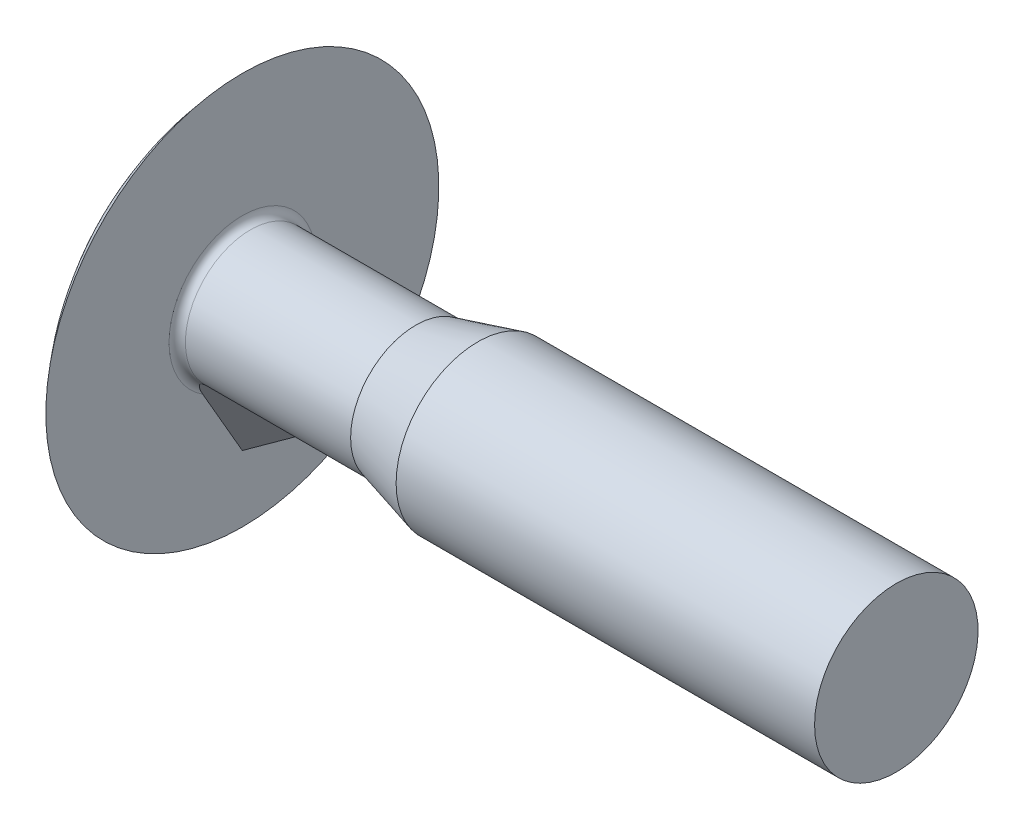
from build123d import *

# Parameters (mm, degrees)
SKETCH2_R      = 5
BASEBODY_DEPTH = 40
FILLET1_R      = 0.5


with BuildPart() as part:
    # Sketch1 → BaseHead (revolve)
    with BuildSketch(Plane(origin=(-7.690583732, 4.327735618, 0), x_dir=(0, 1, 0), z_dir=(0, 0, 1)), mode=Mode.PRIVATE) as basehead_sk:
        with BuildLine():
            Line((-4.327735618, -12.290583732), (-16.346054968, -12.290583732))
            ThreePointArc((-16.346054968, -12.290583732), (-10.762018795, -8.879872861), (-4.327735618, -7.690583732))
            Line((-4.327735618, -7.690583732), (-4.327735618, -12.290583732))
        make_face()
    revolve(basehead_sk.sketch.rotate(Axis((-9.007048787, 0, 0), (1, 0, 0)), 180), axis=Axis((-9.007048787, 0, 0), (1, 0, 0)))

    # Sketch2 → BaseBody (add)
    with BuildSketch(Plane(origin=(4.6, 0, 0), x_dir=(0, 0, -1), z_dir=(1, 0, 0))):
        with Locations(Location((0, 0, 0), (0, 0, 90))):
            Circle(SKETCH2_R)
    extrude(amount=BASEBODY_DEPTH)

    # Sketch3 → Cut-Revolve1 (revolve, cut)
    with BuildSketch(Plane(origin=(-15.854395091, 0, 20.854395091), x_dir=(0, 0, -1), z_dir=(0, 1, 0)), mode=Mode.PRIVATE) as cut_revolve1_sk:
        Polygon((25.854395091, -34.860395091), (24.83618816, -31.060395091), (24.83618816, -20.454395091), (25.854395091, -20.454395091), align=None)
    revolve(cut_revolve1_sk.sketch.rotate(Axis((-22.018002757, 0, 0), (1, 0, 0)), 180), axis=Axis((-22.018002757, 0, 0), (1, 0, 0)), mode=Mode.SUBTRACT)

    # Fillet1
    fillet1_edges = [part.edges().sort_by_distance(p)[0] for p in [
        (4.6, 0, -3.981793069),
    ]]
    fillet(fillet1_edges, radius=FILLET1_R)

    # Sketch4 → Nib section 0
    with BuildSketch(Plane(origin=(4.6, 10.71872448, 8.842645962), x_dir=(0, 0, 1), z_dir=(1, 0, 0)), mode=Mode.PRIVATE) as nib_s0:
        with BuildLine():
            Line((-12.290979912, 12.709621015), (-8.842645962, 18.682310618))
            Line((-8.842645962, 18.682310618), (-5.394312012, 12.709621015))
            Line((-5.394312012, 12.709621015), (-12.290979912, 12.709621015))
        make_face()
    loft([nib_s0.sketch, Vertex(10.1, -3.981793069, 0)])


solid = part.part
